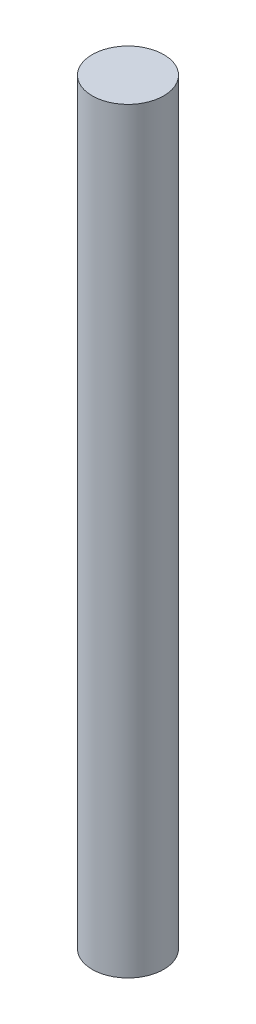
ISO-10303-21;
HEADER;
FILE_DESCRIPTION(('STEP AP214'),'2;1');
FILE_NAME('part.step','',(''),(''),'','','');
FILE_SCHEMA(('AUTOMOTIVE_DESIGN { 1 0 10303 214 1 1 1 1 }'));
ENDSEC;
DATA;
#1=APPLICATION_CONTEXT('core data for automotive mechanical design processes');
#2=APPLICATION_PROTOCOL_DEFINITION('international standard','automotive_design',2000,#1);
#3=PRODUCT_CONTEXT('',#1,'mechanical');
#4=PRODUCT('Part','Part','',(#3));
#5=PRODUCT_RELATED_PRODUCT_CATEGORY('part','',(#4));
#6=PRODUCT_DEFINITION_FORMATION('','',#4);
#7=PRODUCT_DEFINITION_CONTEXT('part definition',#1,'design');
#8=PRODUCT_DEFINITION('design','',#6,#7);
#9=PRODUCT_DEFINITION_SHAPE('','',#8);
#10=(LENGTH_UNIT() NAMED_UNIT(*) SI_UNIT(.MILLI.,.METRE.));
#11=(NAMED_UNIT(*) PLANE_ANGLE_UNIT() SI_UNIT($,.RADIAN.));
#12=(NAMED_UNIT(*) SI_UNIT($,.STERADIAN.) SOLID_ANGLE_UNIT());
#13=UNCERTAINTY_MEASURE_WITH_UNIT(LENGTH_MEASURE(1.E-05),#10,'distance_accuracy_value','');
#14=(GEOMETRIC_REPRESENTATION_CONTEXT(3) GLOBAL_UNCERTAINTY_ASSIGNED_CONTEXT((#13)) GLOBAL_UNIT_ASSIGNED_CONTEXT((#10,
#11,#12)) REPRESENTATION_CONTEXT('',''));
#15=CARTESIAN_POINT('',(0.,0.,0.));
#16=DIRECTION('',(0.,0.,1.));
#17=DIRECTION('',(1.,0.,0.));
#18=AXIS2_PLACEMENT_3D('',#15,#16,#17);
#19=CARTESIAN_POINT('',(0.,73.,0.));
#20=DIRECTION('',(0.,-1.,0.));
#21=DIRECTION('',(0.,0.,-1.));
#22=AXIS2_PLACEMENT_3D('',#19,#20,#21);
#23=CYLINDRICAL_SURFACE('',#22,3.45);
#24=CARTESIAN_POINT('',(0.,73.,0.));
#25=DIRECTION('',(0.,1.,0.));
#26=DIRECTION('',(0.,0.,1.));
#27=AXIS2_PLACEMENT_3D('',#24,#25,#26);
#28=CIRCLE('',#27,3.45);
#29=CARTESIAN_POINT('',(0.,73.,3.45));
#30=VERTEX_POINT('',#29);
#31=EDGE_CURVE('E10',#30,#30,#28,.T.);
#32=ORIENTED_EDGE('',*,*,#31,.F.);
#33=EDGE_LOOP('',(#32));
#34=FACE_BOUND('',#33,.T.);
#35=CARTESIAN_POINT('',(0.,0.,0.));
#36=DIRECTION('',(0.,1.,0.));
#37=DIRECTION('',(0.,0.,1.));
#38=AXIS2_PLACEMENT_3D('',#35,#36,#37);
#39=CIRCLE('',#38,3.45);
#40=CARTESIAN_POINT('',(0.,0.,3.45));
#41=VERTEX_POINT('',#40);
#42=EDGE_CURVE('E33',#41,#41,#39,.T.);
#43=ORIENTED_EDGE('',*,*,#42,.T.);
#44=EDGE_LOOP('',(#43));
#45=FACE_BOUND('',#44,.T.);
#46=ADVANCED_FACE('F30',(#34,#45),#23,.T.);
#47=CARTESIAN_POINT('',(0.,73.,0.));
#48=DIRECTION('',(0.,1.,0.));
#49=DIRECTION('',(0.,0.,1.));
#50=AXIS2_PLACEMENT_3D('',#47,#48,#49);
#51=PLANE('',#50);
#52=ORIENTED_EDGE('',*,*,#31,.T.);
#53=EDGE_LOOP('',(#52));
#54=FACE_BOUND('',#53,.T.);
#55=ADVANCED_FACE('F45',(#54),#51,.T.);
#56=CARTESIAN_POINT('',(0.,0.,0.));
#57=DIRECTION('',(0.,1.,0.));
#58=DIRECTION('',(0.,0.,1.));
#59=AXIS2_PLACEMENT_3D('',#56,#57,#58);
#60=PLANE('',#59);
#61=ORIENTED_EDGE('',*,*,#42,.F.);
#62=EDGE_LOOP('',(#61));
#63=FACE_BOUND('',#62,.T.);
#64=ADVANCED_FACE('F43',(#63),#60,.F.);
#65=CLOSED_SHELL('',(#46,#55,#64));
#66=MANIFOLD_SOLID_BREP('B2',#65);
#67=ADVANCED_BREP_SHAPE_REPRESENTATION('',(#18,#66),#14);
#68=SHAPE_DEFINITION_REPRESENTATION(#9,#67);
ENDSEC;
END-ISO-10303-21;
